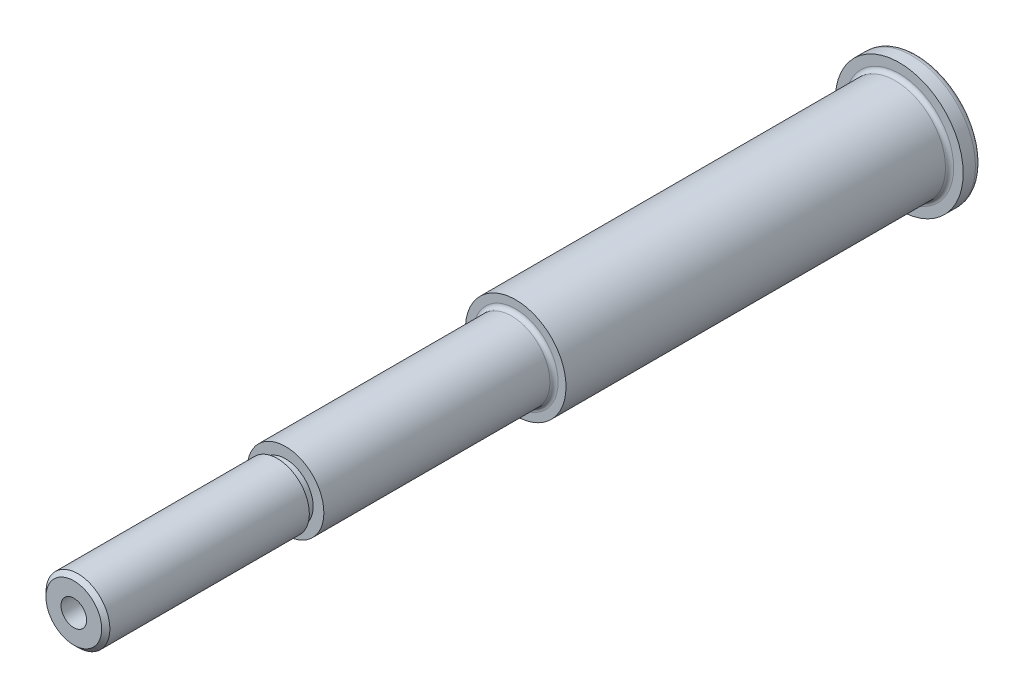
from build123d import *

# Parameters (mm, degrees)
SKETCH3_R          = 3.175
CUT_EXTRUDE1_DEPTH = 34.925


with BuildPart() as part:
    # Sketch2 → Base-Revolve (revolve)
    with BuildSketch(Plane(origin=(0, 0, 0), x_dir=(0, 0, -1), z_dir=(1, 0, 0)), mode=Mode.PRIVATE) as base_revolve_sk:
        with BuildLine():
            Line((0, 0), (0, 14.351))
            ThreePointArc((0, 14.351), (-0.446369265, 15.428630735), (-1.524, 15.875))
            Line((-1.524, 15.875), (-4.572, 15.875))
            Line((-4.572, 15.875), (-4.572, 13.5128))
            ThreePointArc((-4.572, 13.5128), (-4.86957951, 12.79437951), (-5.588, 12.4968))
            Line((-5.588, 12.4968), (-99.822, 12.4968))
            Line((-99.822, 12.4968), (-99.822, 10.5283))
            ThreePointArc((-99.822, 10.5283), (-100.11957951, 9.80987951), (-100.838, 9.5123))
            Line((-100.838, 9.5123), (-156.972, 9.5123))
            Line((-156.972, 9.5123), (-156.972, 6.858))
            Line((-156.972, 6.858), (-159.004, 6.858))
            Line((-159.004, 6.858), (-159.004, 7.9375))
            Line((-159.004, 7.9375), (-208.534, 7.9375))
            Line((-208.534, 7.9375), (-209.55, 6.9215))
            Line((-209.55, 6.9215), (-209.55, 0))
            Line((-209.55, 0), (0, 0))
        make_face()
    revolve(base_revolve_sk.sketch.rotate(Axis((0, 0, 0), (0, 0, -1)), 90), axis=Axis((0, 0, 0), (0, 0, -1)))

    # Sketch3 → Cut-Extrude1 (cut)
    with BuildSketch(Plane.XY.offset(209.55)):
        Circle(SKETCH3_R)
    extrude(amount=-CUT_EXTRUDE1_DEPTH, mode=Mode.SUBTRACT)


solid = part.part
